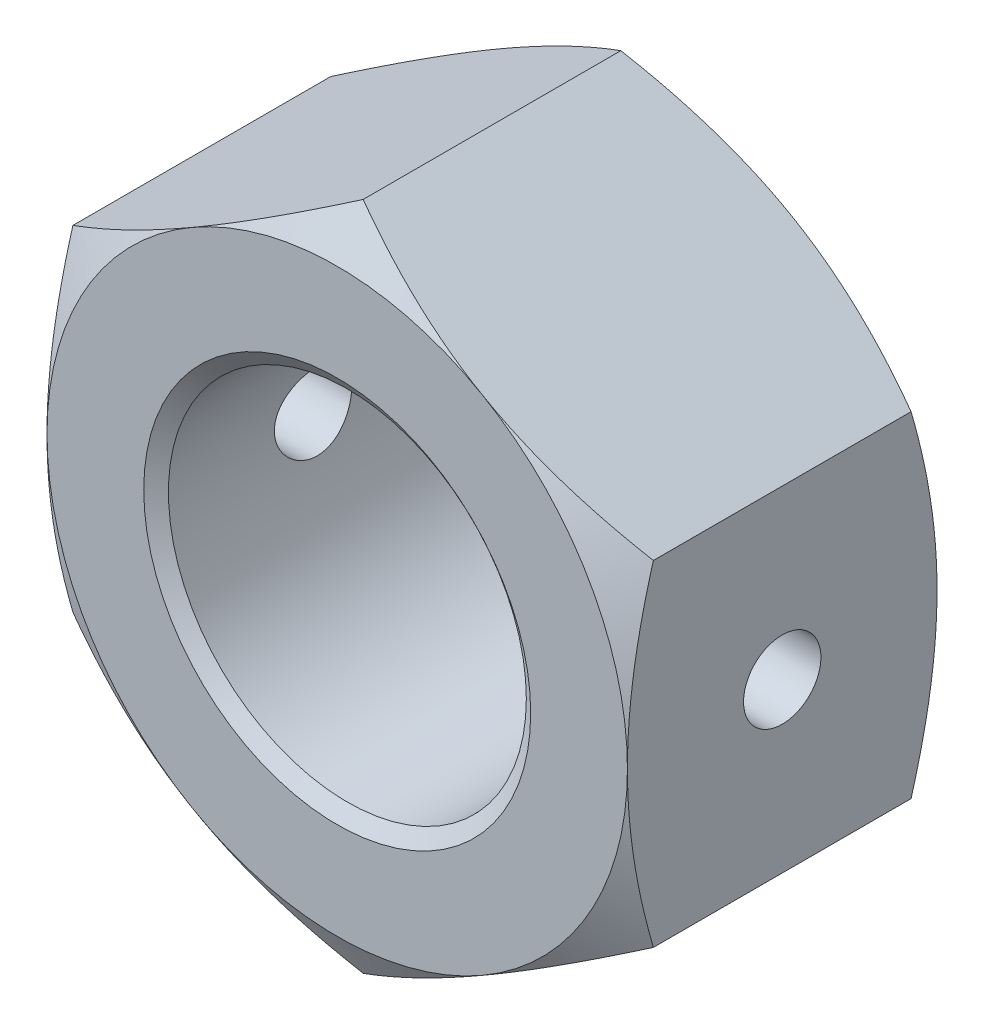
from build123d import *

# Parameters (mm, degrees)
BASENUTSKE_R            = 9.25
BASENUT_DEPTH           = 16
ESQUISSE4_R             = 2
ENL_V_MAT_EXTRU_1_DEPTH = 39.157568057


with BuildPart() as part:
    # BaseNutSke → BaseNut (new body)
    with BuildSketch(Plane.XY):
        Polygon((15, 8.660254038), (15, -8.660254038), (0, -17.320508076), (-15, -8.660254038), (-15, 8.660254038), (0, 17.320508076), align=None)
        Circle(BASENUTSKE_R, mode=Mode.SUBTRACT)
    extrude(amount=-BASENUT_DEPTH)

    # Sketch3 → Double-Chamfer (revolve, cut)
    with BuildSketch(Plane(origin=(0, 0, 0), x_dir=(0, 0, -1), z_dir=(1, 0, 0))):
        Polygon((16, 15), (14.660254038, 17.320508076), (14.660254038, 27.320508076), (26, 27.320508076), (26, 15), align=None)
        Polygon((1.339745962, 27.320508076), (-10, 27.320508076), (-10, 15), (0, 15), (1.339745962, 17.320508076), align=None)
    revolve(axis=Axis((0, 0, 0), (0, 0, -1)), mode=Mode.SUBTRACT)

    # Sketch5 → EndChamfer (revolve, cut)
    with BuildSketch(Plane(origin=(0, 0, 0), x_dir=(0, 0, -1), z_dir=(1, 0, 0)), mode=Mode.PRIVATE) as endchamfer_sk:
        Polygon((15.9746, 10), (15.011814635, 8.625), (16.0254, 8.625), (16.0254, 10), align=None)
        Polygon((-0.0508, 10), (0, 10), (0.962785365, 8.625), (-0.0508, 8.625), align=None)
    revolve(endchamfer_sk.sketch.rotate(Axis((0, 0, -25.037505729), (0, 0, -1)), 90), axis=Axis((0, 0, -25.037505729), (0, 0, -1)), mode=Mode.SUBTRACT)

    # Esquisse4 → Enl_v. mat.-Extru.1 (cut, through all)
    with BuildSketch(Plane.ZY.offset(15)):
        with Locations((-8, 0)):
            Circle(ESQUISSE4_R)
    extrude(amount=-ENL_V_MAT_EXTRU_1_DEPTH, mode=Mode.SUBTRACT)


solid = part.part
